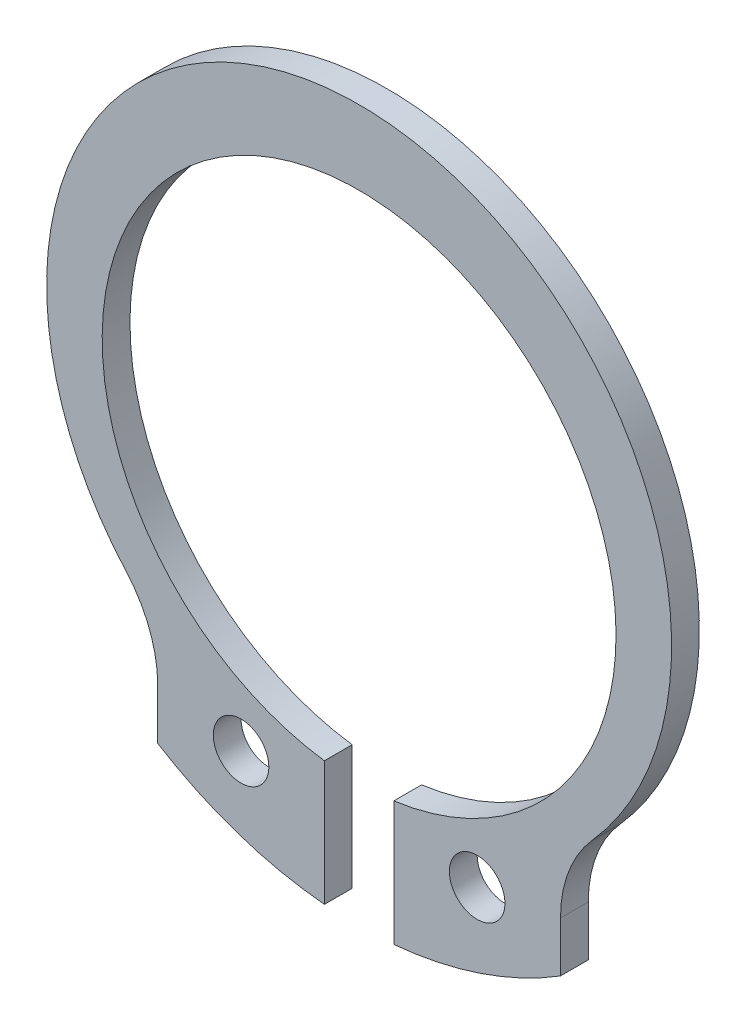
ISO-10303-21;
HEADER;
FILE_DESCRIPTION(('STEP AP214'),'2;1');
FILE_NAME('part.step','',(''),(''),'','','');
FILE_SCHEMA(('AUTOMOTIVE_DESIGN { 1 0 10303 214 1 1 1 1 }'));
ENDSEC;
DATA;
#1=APPLICATION_CONTEXT('core data for automotive mechanical design processes');
#2=APPLICATION_PROTOCOL_DEFINITION('international standard','automotive_design',2000,#1);
#3=PRODUCT_CONTEXT('',#1,'mechanical');
#4=PRODUCT('Part','Part','',(#3));
#5=PRODUCT_RELATED_PRODUCT_CATEGORY('part','',(#4));
#6=PRODUCT_DEFINITION_FORMATION('','',#4);
#7=PRODUCT_DEFINITION_CONTEXT('part definition',#1,'design');
#8=PRODUCT_DEFINITION('design','',#6,#7);
#9=PRODUCT_DEFINITION_SHAPE('','',#8);
#10=(LENGTH_UNIT() NAMED_UNIT(*) SI_UNIT(.MILLI.,.METRE.));
#11=(NAMED_UNIT(*) PLANE_ANGLE_UNIT() SI_UNIT($,.RADIAN.));
#12=(NAMED_UNIT(*) SI_UNIT($,.STERADIAN.) SOLID_ANGLE_UNIT());
#13=UNCERTAINTY_MEASURE_WITH_UNIT(LENGTH_MEASURE(1.E-05),#10,'distance_accuracy_value','');
#14=(GEOMETRIC_REPRESENTATION_CONTEXT(3) GLOBAL_UNCERTAINTY_ASSIGNED_CONTEXT((#13)) GLOBAL_UNIT_ASSIGNED_CONTEXT((#10,
#11,#12)) REPRESENTATION_CONTEXT('',''));
#15=CARTESIAN_POINT('',(0.,0.,0.));
#16=DIRECTION('',(0.,0.,1.));
#17=DIRECTION('',(1.,0.,0.));
#18=AXIS2_PLACEMENT_3D('',#15,#16,#17);
#19=CARTESIAN_POINT('',(0.,0.,-1.));
#20=DIRECTION('',(0.,0.,1.));
#21=DIRECTION('',(1.,0.,0.));
#22=AXIS2_PLACEMENT_3D('',#19,#20,#21);
#23=CYLINDRICAL_SURFACE('',#22,11.25);
#24=CARTESIAN_POINT('',(0.,0.,-1.));
#25=DIRECTION('',(0.,0.,1.));
#26=DIRECTION('',(1.,0.,0.));
#27=AXIS2_PLACEMENT_3D('',#24,#25,#26);
#28=CIRCLE('',#27,11.25);
#29=CARTESIAN_POINT('',(8.39285714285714,-7.49149177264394,-1.));
#30=VERTEX_POINT('',#29);
#31=CARTESIAN_POINT('',(-8.39285714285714,-7.49149177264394,-1.));
#32=VERTEX_POINT('',#31);
#33=EDGE_CURVE('E121',#30,#32,#28,.T.);
#34=ORIENTED_EDGE('',*,*,#33,.T.);
#35=DIRECTION('',(0.,0.,1.));
#36=VECTOR('',#35,1.);
#37=CARTESIAN_POINT('',(-8.39285714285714,-7.49149177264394,-1.));
#38=LINE('',#37,#36);
#39=CARTESIAN_POINT('',(-8.39285714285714,-7.49149177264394,0.));
#40=VERTEX_POINT('',#39);
#41=EDGE_CURVE('E183',#32,#40,#38,.T.);
#42=ORIENTED_EDGE('',*,*,#41,.T.);
#43=CARTESIAN_POINT('',(0.,0.,0.));
#44=DIRECTION('',(0.,0.,1.));
#45=DIRECTION('',(1.,0.,0.));
#46=AXIS2_PLACEMENT_3D('',#43,#44,#45);
#47=CIRCLE('',#46,11.25);
#48=CARTESIAN_POINT('',(8.39285714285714,-7.49149177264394,0.));
#49=VERTEX_POINT('',#48);
#50=EDGE_CURVE('E150',#49,#40,#47,.T.);
#51=ORIENTED_EDGE('',*,*,#50,.F.);
#52=DIRECTION('',(0.,0.,1.));
#53=VECTOR('',#52,1.);
#54=CARTESIAN_POINT('',(8.39285714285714,-7.49149177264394,-1.));
#55=LINE('',#54,#53);
#56=EDGE_CURVE('E174',#49,#30,#55,.F.);
#57=ORIENTED_EDGE('',*,*,#56,.T.);
#58=EDGE_LOOP('',(#34,#42,#51,#57));
#59=FACE_BOUND('',#58,.T.);
#60=ADVANCED_FACE('F33',(#59),#23,.T.);
#61=CARTESIAN_POINT('',(7.25,-8.60232526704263,-1.));
#62=DIRECTION('',(1.,0.,0.));
#63=DIRECTION('',(0.,0.,-1.));
#64=AXIS2_PLACEMENT_3D('',#61,#62,#63);
#65=PLANE('',#64);
#66=DIRECTION('',(0.,1.,0.));
#67=VECTOR('',#66,1.);
#68=CARTESIAN_POINT('',(7.25,-8.60232526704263,-1.));
#69=LINE('',#68,#67);
#70=CARTESIAN_POINT('',(7.25,-12.2944354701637,-1.));
#71=VERTEX_POINT('',#70);
#72=CARTESIAN_POINT('',(7.25,-10.4880884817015,-1.));
#73=VERTEX_POINT('',#72);
#74=EDGE_CURVE('E129',#71,#73,#69,.T.);
#75=ORIENTED_EDGE('',*,*,#74,.T.);
#76=DIRECTION('',(0.,0.,-1.));
#77=VECTOR('',#76,1.);
#78=CARTESIAN_POINT('',(7.25,-10.4880884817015,0.));
#79=LINE('',#78,#77);
#80=CARTESIAN_POINT('',(7.25,-10.4880884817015,0.));
#81=VERTEX_POINT('',#80);
#82=EDGE_CURVE('E187',#73,#81,#79,.F.);
#83=ORIENTED_EDGE('',*,*,#82,.T.);
#84=DIRECTION('',(0.,1.,0.));
#85=VECTOR('',#84,1.);
#86=CARTESIAN_POINT('',(7.25,-8.60232526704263,0.));
#87=LINE('',#86,#85);
#88=CARTESIAN_POINT('',(7.25,-12.2944354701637,0.));
#89=VERTEX_POINT('',#88);
#90=EDGE_CURVE('E169',#89,#81,#87,.T.);
#91=ORIENTED_EDGE('',*,*,#90,.F.);
#92=DIRECTION('',(0.,0.,1.));
#93=VECTOR('',#92,1.);
#94=CARTESIAN_POINT('',(7.25,-12.2944354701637,-1.));
#95=LINE('',#94,#93);
#96=EDGE_CURVE('E172',#71,#89,#95,.T.);
#97=ORIENTED_EDGE('',*,*,#96,.F.);
#98=EDGE_LOOP('',(#75,#83,#91,#97));
#99=FACE_BOUND('',#98,.T.);
#100=ADVANCED_FACE('F200',(#99),#65,.T.);
#101=CARTESIAN_POINT('',(0.,-0.67,-1.));
#102=DIRECTION('',(0.,0.,1.));
#103=DIRECTION('',(1.,0.,0.));
#104=AXIS2_PLACEMENT_3D('',#101,#102,#103);
#105=CYLINDRICAL_SURFACE('',#104,13.7);
#106=CARTESIAN_POINT('',(0.,-0.67,0.));
#107=DIRECTION('',(0.,0.,1.));
#108=DIRECTION('',(-1.,0.,0.));
#109=AXIS2_PLACEMENT_3D('',#106,#107,#108);
#110=CIRCLE('',#109,13.7);
#111=CARTESIAN_POINT('',(1.25,-14.3128552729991,0.));
#112=VERTEX_POINT('',#111);
#113=EDGE_CURVE('E166',#112,#89,#110,.T.);
#114=ORIENTED_EDGE('',*,*,#113,.F.);
#115=DIRECTION('',(0.,0.,1.));
#116=VECTOR('',#115,1.);
#117=CARTESIAN_POINT('',(1.25,-14.3128552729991,-1.));
#118=LINE('',#117,#116);
#119=CARTESIAN_POINT('',(1.25,-14.3128552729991,-1.));
#120=VERTEX_POINT('',#119);
#121=EDGE_CURVE('E175',#120,#112,#118,.T.);
#122=ORIENTED_EDGE('',*,*,#121,.F.);
#123=CARTESIAN_POINT('',(0.,-0.67,-1.));
#124=DIRECTION('',(0.,0.,1.));
#125=DIRECTION('',(-1.,0.,0.));
#126=AXIS2_PLACEMENT_3D('',#123,#124,#125);
#127=CIRCLE('',#126,13.7);
#128=EDGE_CURVE('E146',#120,#71,#127,.T.);
#129=ORIENTED_EDGE('',*,*,#128,.T.);
#130=ORIENTED_EDGE('',*,*,#96,.T.);
#131=EDGE_LOOP('',(#114,#122,#129,#130));
#132=FACE_BOUND('',#131,.T.);
#133=ADVANCED_FACE('F255',(#132),#105,.T.);
#134=CARTESIAN_POINT('',(1.25,-14.3128552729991,-1.));
#135=DIRECTION('',(-1.,0.,0.));
#136=DIRECTION('',(0.,-1.,0.));
#137=AXIS2_PLACEMENT_3D('',#134,#135,#136);
#138=PLANE('',#137);
#139=DIRECTION('',(0.,-1.,0.));
#140=VECTOR('',#139,1.);
#141=CARTESIAN_POINT('',(1.25,-14.3128552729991,0.));
#142=LINE('',#141,#140);
#143=CARTESIAN_POINT('',(1.25,-9.83515138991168,0.));
#144=VERTEX_POINT('',#143);
#145=EDGE_CURVE('E163',#144,#112,#142,.T.);
#146=ORIENTED_EDGE('',*,*,#145,.F.);
#147=DIRECTION('',(0.,0.,1.));
#148=VECTOR('',#147,1.);
#149=CARTESIAN_POINT('',(1.25,-9.83515138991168,-1.));
#150=LINE('',#149,#148);
#151=CARTESIAN_POINT('',(1.25,-9.83515138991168,-1.));
#152=VERTEX_POINT('',#151);
#153=EDGE_CURVE('E177',#152,#144,#150,.T.);
#154=ORIENTED_EDGE('',*,*,#153,.F.);
#155=DIRECTION('',(0.,-1.,0.));
#156=VECTOR('',#155,1.);
#157=CARTESIAN_POINT('',(1.25,-14.3128552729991,-1.));
#158=LINE('',#157,#156);
#159=EDGE_CURVE('E143',#152,#120,#158,.T.);
#160=ORIENTED_EDGE('',*,*,#159,.T.);
#161=ORIENTED_EDGE('',*,*,#121,.T.);
#162=EDGE_LOOP('',(#146,#154,#160,#161));
#163=FACE_BOUND('',#162,.T.);
#164=ADVANCED_FACE('F206',(#163),#138,.T.);
#165=CARTESIAN_POINT('',(0.,-0.67,-1.));
#166=DIRECTION('',(0.,0.,1.));
#167=DIRECTION('',(1.,0.,0.));
#168=AXIS2_PLACEMENT_3D('',#165,#166,#167);
#169=CYLINDRICAL_SURFACE('',#168,9.25);
#170=CARTESIAN_POINT('',(0.,-0.67,0.));
#171=DIRECTION('',(0.,0.,-1.));
#172=DIRECTION('',(1.,0.,0.));
#173=AXIS2_PLACEMENT_3D('',#170,#171,#172);
#174=CIRCLE('',#173,9.25);
#175=CARTESIAN_POINT('',(-1.25,-9.83515138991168,0.));
#176=VERTEX_POINT('',#175);
#177=EDGE_CURVE('E160',#176,#144,#174,.T.);
#178=ORIENTED_EDGE('',*,*,#177,.F.);
#179=DIRECTION('',(0.,0.,1.));
#180=VECTOR('',#179,1.);
#181=CARTESIAN_POINT('',(-1.25,-9.83515138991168,-1.));
#182=LINE('',#181,#180);
#183=CARTESIAN_POINT('',(-1.25,-9.83515138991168,-1.));
#184=VERTEX_POINT('',#183);
#185=EDGE_CURVE('E179',#184,#176,#182,.T.);
#186=ORIENTED_EDGE('',*,*,#185,.F.);
#187=CARTESIAN_POINT('',(0.,-0.67,-1.));
#188=DIRECTION('',(0.,0.,-1.));
#189=DIRECTION('',(1.,0.,0.));
#190=AXIS2_PLACEMENT_3D('',#187,#188,#189);
#191=CIRCLE('',#190,9.25);
#192=EDGE_CURVE('E137',#184,#152,#191,.T.);
#193=ORIENTED_EDGE('',*,*,#192,.T.);
#194=ORIENTED_EDGE('',*,*,#153,.T.);
#195=EDGE_LOOP('',(#178,#186,#193,#194));
#196=FACE_BOUND('',#195,.T.);
#197=ADVANCED_FACE('F210',(#196),#169,.F.);
#198=CARTESIAN_POINT('',(-1.25,-14.3128552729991,-1.));
#199=DIRECTION('',(1.,0.,0.));
#200=DIRECTION('',(0.,1.,0.));
#201=AXIS2_PLACEMENT_3D('',#198,#199,#200);
#202=PLANE('',#201);
#203=DIRECTION('',(0.,1.,0.));
#204=VECTOR('',#203,1.);
#205=CARTESIAN_POINT('',(-1.25,-14.3128552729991,0.));
#206=LINE('',#205,#204);
#207=CARTESIAN_POINT('',(-1.25000000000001,-14.3128552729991,0.));
#208=VERTEX_POINT('',#207);
#209=EDGE_CURVE('E157',#208,#176,#206,.T.);
#210=ORIENTED_EDGE('',*,*,#209,.F.);
#211=DIRECTION('',(0.,0.,1.));
#212=VECTOR('',#211,1.);
#213=CARTESIAN_POINT('',(-1.25000000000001,-14.3128552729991,-1.));
#214=LINE('',#213,#212);
#215=CARTESIAN_POINT('',(-1.25000000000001,-14.3128552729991,-1.));
#216=VERTEX_POINT('',#215);
#217=EDGE_CURVE('E128',#216,#208,#214,.T.);
#218=ORIENTED_EDGE('',*,*,#217,.F.);
#219=DIRECTION('',(0.,1.,0.));
#220=VECTOR('',#219,1.);
#221=CARTESIAN_POINT('',(-1.25,-14.3128552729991,-1.));
#222=LINE('',#221,#220);
#223=EDGE_CURVE('E135',#216,#184,#222,.T.);
#224=ORIENTED_EDGE('',*,*,#223,.T.);
#225=ORIENTED_EDGE('',*,*,#185,.T.);
#226=EDGE_LOOP('',(#210,#218,#224,#225));
#227=FACE_BOUND('',#226,.T.);
#228=ADVANCED_FACE('F213',(#227),#202,.T.);
#229=CARTESIAN_POINT('',(0.,-0.67,-1.));
#230=DIRECTION('',(0.,0.,1.));
#231=DIRECTION('',(1.,0.,0.));
#232=AXIS2_PLACEMENT_3D('',#229,#230,#231);
#233=CYLINDRICAL_SURFACE('',#232,13.7);
#234=CARTESIAN_POINT('',(0.,-0.67,0.));
#235=DIRECTION('',(0.,0.,1.));
#236=DIRECTION('',(1.,0.,0.));
#237=AXIS2_PLACEMENT_3D('',#234,#235,#236);
#238=CIRCLE('',#237,13.7);
#239=CARTESIAN_POINT('',(-7.25,-12.2944354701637,0.));
#240=VERTEX_POINT('',#239);
#241=EDGE_CURVE('E127',#240,#208,#238,.T.);
#242=ORIENTED_EDGE('',*,*,#241,.F.);
#243=DIRECTION('',(0.,0.,1.));
#244=VECTOR('',#243,1.);
#245=CARTESIAN_POINT('',(-7.25,-12.2944354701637,-1.));
#246=LINE('',#245,#244);
#247=CARTESIAN_POINT('',(-7.25,-12.2944354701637,-1.));
#248=VERTEX_POINT('',#247);
#249=EDGE_CURVE('E114',#248,#240,#246,.T.);
#250=ORIENTED_EDGE('',*,*,#249,.F.);
#251=CARTESIAN_POINT('',(0.,-0.67,-1.));
#252=DIRECTION('',(0.,0.,1.));
#253=DIRECTION('',(1.,0.,0.));
#254=AXIS2_PLACEMENT_3D('',#251,#252,#253);
#255=CIRCLE('',#254,13.7);
#256=EDGE_CURVE('E120',#248,#216,#255,.T.);
#257=ORIENTED_EDGE('',*,*,#256,.T.);
#258=ORIENTED_EDGE('',*,*,#217,.T.);
#259=EDGE_LOOP('',(#242,#250,#257,#258));
#260=FACE_BOUND('',#259,.T.);
#261=ADVANCED_FACE('F125',(#260),#233,.T.);
#262=CARTESIAN_POINT('',(-7.25,-8.60232526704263,-1.));
#263=DIRECTION('',(-1.,0.,0.));
#264=DIRECTION('',(0.,0.,1.));
#265=AXIS2_PLACEMENT_3D('',#262,#263,#264);
#266=PLANE('',#265);
#267=DIRECTION('',(0.,-1.,0.));
#268=VECTOR('',#267,1.);
#269=CARTESIAN_POINT('',(-7.25,-8.60232526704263,0.));
#270=LINE('',#269,#268);
#271=CARTESIAN_POINT('',(-7.25,-10.4880884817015,0.));
#272=VERTEX_POINT('',#271);
#273=EDGE_CURVE('E153',#272,#240,#270,.T.);
#274=ORIENTED_EDGE('',*,*,#273,.F.);
#275=DIRECTION('',(0.,0.,-1.));
#276=VECTOR('',#275,1.);
#277=CARTESIAN_POINT('',(-7.25,-10.4880884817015,-1.));
#278=LINE('',#277,#276);
#279=CARTESIAN_POINT('',(-7.25,-10.4880884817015,-1.));
#280=VERTEX_POINT('',#279);
#281=EDGE_CURVE('E117',#272,#280,#278,.T.);
#282=ORIENTED_EDGE('',*,*,#281,.T.);
#283=DIRECTION('',(0.,-1.,0.));
#284=VECTOR('',#283,1.);
#285=CARTESIAN_POINT('',(-7.25,-8.60232526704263,-1.));
#286=LINE('',#285,#284);
#287=EDGE_CURVE('E110',#280,#248,#286,.T.);
#288=ORIENTED_EDGE('',*,*,#287,.T.);
#289=ORIENTED_EDGE('',*,*,#249,.T.);
#290=EDGE_LOOP('',(#274,#282,#288,#289));
#291=FACE_BOUND('',#290,.T.);
#292=ADVANCED_FACE('F113',(#291),#266,.T.);
#293=CARTESIAN_POINT('',(0.,0.,-1.));
#294=DIRECTION('',(0.,0.,1.));
#295=DIRECTION('',(1.,0.,0.));
#296=AXIS2_PLACEMENT_3D('',#293,#294,#295);
#297=PLANE('',#296);
#298=CARTESIAN_POINT('',(4.25,-11.0323115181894,-1.));
#299=DIRECTION('',(0.,0.,1.));
#300=DIRECTION('',(-1.,0.,0.));
#301=AXIS2_PLACEMENT_3D('',#298,#299,#300);
#302=CIRCLE('',#301,0.999999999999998);
#303=CARTESIAN_POINT('',(3.25000000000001,-11.0323115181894,-1.));
#304=VERTEX_POINT('',#303);
#305=EDGE_CURVE('E220',#304,#304,#302,.T.);
#306=ORIENTED_EDGE('',*,*,#305,.T.);
#307=EDGE_LOOP('',(#306));
#308=FACE_BOUND('',#307,.T.);
#309=CARTESIAN_POINT('',(-4.25,-11.0323115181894,-1.));
#310=DIRECTION('',(0.,0.,1.));
#311=DIRECTION('',(1.,0.,0.));
#312=AXIS2_PLACEMENT_3D('',#309,#310,#311);
#313=CIRCLE('',#312,1.);
#314=CARTESIAN_POINT('',(-3.25,-11.0323115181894,-1.));
#315=VERTEX_POINT('',#314);
#316=EDGE_CURVE('E154',#315,#315,#313,.T.);
#317=ORIENTED_EDGE('',*,*,#316,.T.);
#318=EDGE_LOOP('',(#317));
#319=FACE_BOUND('',#318,.T.);
#320=ORIENTED_EDGE('',*,*,#33,.F.);
#321=CARTESIAN_POINT('',(11.75,-10.4880884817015,-1.));
#322=DIRECTION('',(0.,0.,1.));
#323=DIRECTION('',(1.,0.,0.));
#324=AXIS2_PLACEMENT_3D('',#321,#322,#323);
#325=CIRCLE('',#324,4.5);
#326=EDGE_CURVE('E11',#30,#73,#325,.T.);
#327=ORIENTED_EDGE('',*,*,#326,.T.);
#328=ORIENTED_EDGE('',*,*,#74,.F.);
#329=ORIENTED_EDGE('',*,*,#128,.F.);
#330=ORIENTED_EDGE('',*,*,#159,.F.);
#331=ORIENTED_EDGE('',*,*,#192,.F.);
#332=ORIENTED_EDGE('',*,*,#223,.F.);
#333=ORIENTED_EDGE('',*,*,#256,.F.);
#334=ORIENTED_EDGE('',*,*,#287,.F.);
#335=CARTESIAN_POINT('',(-11.75,-10.4880884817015,-1.));
#336=DIRECTION('',(0.,0.,1.));
#337=DIRECTION('',(1.,0.,0.));
#338=AXIS2_PLACEMENT_3D('',#335,#336,#337);
#339=CIRCLE('',#338,4.5);
#340=EDGE_CURVE('E191',#280,#32,#339,.T.);
#341=ORIENTED_EDGE('',*,*,#340,.T.);
#342=EDGE_LOOP('',(#320,#327,#328,#329,#330,#331,#332,#333,#334,#341));
#343=FACE_BOUND('',#342,.T.);
#344=ADVANCED_FACE('F132',(#308,#319,#343),#297,.F.);
#345=CARTESIAN_POINT('',(0.,0.,0.));
#346=DIRECTION('',(0.,0.,1.));
#347=DIRECTION('',(1.,0.,0.));
#348=AXIS2_PLACEMENT_3D('',#345,#346,#347);
#349=PLANE('',#348);
#350=CARTESIAN_POINT('',(4.25,-11.0323115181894,0.));
#351=DIRECTION('',(0.,0.,1.));
#352=DIRECTION('',(-1.,0.,0.));
#353=AXIS2_PLACEMENT_3D('',#350,#351,#352);
#354=CIRCLE('',#353,0.999999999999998);
#355=CARTESIAN_POINT('',(3.25000000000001,-11.0323115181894,0.));
#356=VERTEX_POINT('',#355);
#357=EDGE_CURVE('E223',#356,#356,#354,.T.);
#358=ORIENTED_EDGE('',*,*,#357,.F.);
#359=EDGE_LOOP('',(#358));
#360=FACE_BOUND('',#359,.T.);
#361=CARTESIAN_POINT('',(-4.25,-11.0323115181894,0.));
#362=DIRECTION('',(0.,0.,1.));
#363=DIRECTION('',(1.,0.,0.));
#364=AXIS2_PLACEMENT_3D('',#361,#362,#363);
#365=CIRCLE('',#364,1.);
#366=CARTESIAN_POINT('',(-3.25,-11.0323115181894,0.));
#367=VERTEX_POINT('',#366);
#368=EDGE_CURVE('E217',#367,#367,#365,.T.);
#369=ORIENTED_EDGE('',*,*,#368,.F.);
#370=EDGE_LOOP('',(#369));
#371=FACE_BOUND('',#370,.T.);
#372=ORIENTED_EDGE('',*,*,#90,.T.);
#373=CARTESIAN_POINT('',(11.75,-10.4880884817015,0.));
#374=DIRECTION('',(0.,0.,1.));
#375=DIRECTION('',(1.,0.,0.));
#376=AXIS2_PLACEMENT_3D('',#373,#374,#375);
#377=CIRCLE('',#376,4.5);
#378=EDGE_CURVE('E41',#81,#49,#377,.F.);
#379=ORIENTED_EDGE('',*,*,#378,.T.);
#380=ORIENTED_EDGE('',*,*,#50,.T.);
#381=CARTESIAN_POINT('',(-11.75,-10.4880884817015,0.));
#382=DIRECTION('',(0.,0.,1.));
#383=DIRECTION('',(1.,0.,0.));
#384=AXIS2_PLACEMENT_3D('',#381,#382,#383);
#385=CIRCLE('',#384,4.5);
#386=EDGE_CURVE('E189',#40,#272,#385,.F.);
#387=ORIENTED_EDGE('',*,*,#386,.T.);
#388=ORIENTED_EDGE('',*,*,#273,.T.);
#389=ORIENTED_EDGE('',*,*,#241,.T.);
#390=ORIENTED_EDGE('',*,*,#209,.T.);
#391=ORIENTED_EDGE('',*,*,#177,.T.);
#392=ORIENTED_EDGE('',*,*,#145,.T.);
#393=ORIENTED_EDGE('',*,*,#113,.T.);
#394=EDGE_LOOP('',(#372,#379,#380,#387,#388,#389,#390,#391,#392,#393));
#395=FACE_BOUND('',#394,.T.);
#396=ADVANCED_FACE('F194',(#360,#371,#395),#349,.T.);
#397=CARTESIAN_POINT('',(-4.25,-11.0323115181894,-1.));
#398=DIRECTION('',(0.,0.,1.));
#399=DIRECTION('',(1.,0.,0.));
#400=AXIS2_PLACEMENT_3D('',#397,#398,#399);
#401=CYLINDRICAL_SURFACE('',#400,1.);
#402=ORIENTED_EDGE('',*,*,#316,.F.);
#403=EDGE_LOOP('',(#402));
#404=FACE_BOUND('',#403,.T.);
#405=ORIENTED_EDGE('',*,*,#368,.T.);
#406=EDGE_LOOP('',(#405));
#407=FACE_BOUND('',#406,.T.);
#408=ADVANCED_FACE('F234',(#404,#407),#401,.F.);
#409=CARTESIAN_POINT('',(4.25,-11.0323115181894,-1.));
#410=DIRECTION('',(0.,0.,1.));
#411=DIRECTION('',(1.,0.,0.));
#412=AXIS2_PLACEMENT_3D('',#409,#410,#411);
#413=CYLINDRICAL_SURFACE('',#412,0.999999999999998);
#414=ORIENTED_EDGE('',*,*,#305,.F.);
#415=EDGE_LOOP('',(#414));
#416=FACE_BOUND('',#415,.T.);
#417=ORIENTED_EDGE('',*,*,#357,.T.);
#418=EDGE_LOOP('',(#417));
#419=FACE_BOUND('',#418,.T.);
#420=ADVANCED_FACE('F231',(#416,#419),#413,.F.);
#421=CARTESIAN_POINT('',(-11.75,-10.4880884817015,-1.));
#422=DIRECTION('',(0.,0.,1.));
#423=DIRECTION('',(1.,0.,0.));
#424=AXIS2_PLACEMENT_3D('',#421,#422,#423);
#425=CYLINDRICAL_SURFACE('',#424,4.5);
#426=ORIENTED_EDGE('',*,*,#340,.F.);
#427=ORIENTED_EDGE('',*,*,#281,.F.);
#428=ORIENTED_EDGE('',*,*,#386,.F.);
#429=ORIENTED_EDGE('',*,*,#41,.F.);
#430=EDGE_LOOP('',(#426,#427,#428,#429));
#431=FACE_BOUND('',#430,.T.);
#432=ADVANCED_FACE('F215',(#431),#425,.F.);
#433=CARTESIAN_POINT('',(11.75,-10.4880884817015,-1.));
#434=DIRECTION('',(0.,0.,1.));
#435=DIRECTION('',(1.,0.,0.));
#436=AXIS2_PLACEMENT_3D('',#433,#434,#435);
#437=CYLINDRICAL_SURFACE('',#436,4.5);
#438=ORIENTED_EDGE('',*,*,#326,.F.);
#439=ORIENTED_EDGE('',*,*,#56,.F.);
#440=ORIENTED_EDGE('',*,*,#378,.F.);
#441=ORIENTED_EDGE('',*,*,#82,.F.);
#442=EDGE_LOOP('',(#438,#439,#440,#441));
#443=FACE_BOUND('',#442,.T.);
#444=ADVANCED_FACE('F35',(#443),#437,.F.);
#445=CLOSED_SHELL('',(#60,#100,#133,#164,#197,#228,#261,#292,#344,#396,#408,#420,#432,#444));
#446=MANIFOLD_SOLID_BREP('B2',#445);
#447=ADVANCED_BREP_SHAPE_REPRESENTATION('',(#18,#446),#14);
#448=SHAPE_DEFINITION_REPRESENTATION(#9,#447);
ENDSEC;
END-ISO-10303-21;
